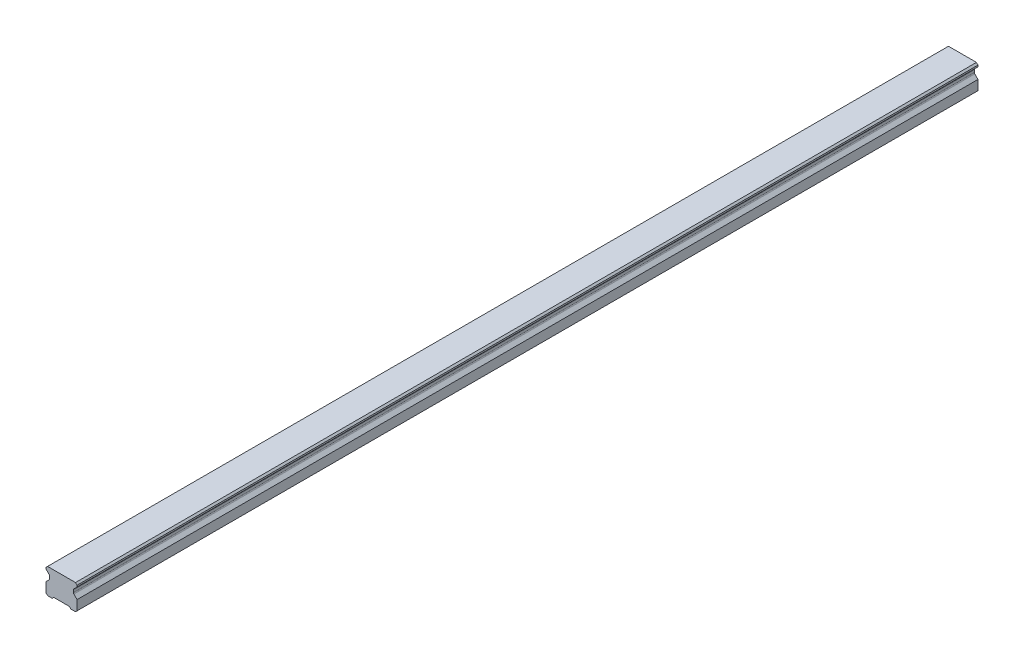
from build123d import *

# Parameters (mm, degrees)
SKETCH1_W           = 20
SKETCH1_H           = 16.3
BOSS_EXTRUDE1_DEPTH = 290
CUT_EXTRUDE1_DEPTH  = 581.315164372
CHAMFER1_SIZE       = 1
FILLET1_R           = 1
CUT_EXTRUDE2_DEPTH  = 581.315164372
SKETCH5_R           = 3
SKETCH5_R_2         = 2.5
CUT_EXTRUDE5_DEPTH  = 10
SKETCH5_2_R         = 2.5
CUT_EXTRUDE6_DEPTH  = 13
LPATTERN2_COUNT     = 10
LPATTERN2_PITCH     = 60


with BuildPart() as part:
    # Sketch1 → Boss-Extrude1 (new, symmetric)
    with BuildSketch(Plane.XY):
        with Locations((0, 8.15)):
            Rectangle(SKETCH1_W, SKETCH1_H)
    extrude(amount=BOSS_EXTRUDE1_DEPTH, both=True)

    # Sketch2 → Cut-Extrude1 (cut, through all)
    with BuildSketch(Plane.XY.offset(290)):
        Polygon((-10, 14.3), (-10, 7.3), (-7.666666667, 9.633333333), (-7.666666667, 11.966666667), align=None)
        Polygon((7.666666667, 11.966666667), (10, 14.3), (10, 7.3), (7.666666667, 9.633333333), align=None)
    extrude(amount=-CUT_EXTRUDE1_DEPTH, mode=Mode.SUBTRACT)

    # Chamfer1
    chamfer1_edges = [part.edges().sort_by_distance(p)[0] for p in [
        (-10, 16.3, 0),
        (10, 16.3, 0),
        (10, 0, 0),
        (-10, 0, 0),
    ]]
    chamfer(chamfer1_edges, length=CHAMFER1_SIZE)

    # Fillet1
    fillet1_edges = [part.edges().sort_by_distance(p)[0] for p in [
        (-7.666666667, 11.966666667, 0),
        (-7.666666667, 9.633333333, 0),
        (7.666666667, 9.633333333, 0),
        (7.666666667, 11.966666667, 0),
    ]]
    fillet(fillet1_edges, radius=FILLET1_R)

    # Sketch3 → Cut-Extrude2 (cut, through all)
    with BuildSketch(Plane.XY.offset(290)):
        Polygon((-6, 0), (-5, 1), (5, 1), (6, 0), align=None)
    extrude(amount=-CUT_EXTRUDE2_DEPTH, mode=Mode.SUBTRACT)

    # Sketch5 → Cut-Extrude5 (cut)
    with BuildSketch(Plane.XZ.offset(-1)):
        with Locations(Location((0, 270, 0), (0, 0, 270))):
            Circle(SKETCH5_R)
        with Locations(Location((0, 270, 0), (0, 0, 270))):
            Circle(SKETCH5_R_2, mode=Mode.SUBTRACT)
    cut_extrude5 = extrude(amount=-CUT_EXTRUDE5_DEPTH, mode=Mode.SUBTRACT)

    # Sketch5_2 → Cut-Extrude6 (cut)
    with BuildSketch(Plane.XZ.offset(-1)):
        with Locations(Location((0, 270, 0), (0, 0, 270))):
            Circle(SKETCH5_2_R)
    cut_extrude6 = extrude(amount=-CUT_EXTRUDE6_DEPTH, mode=Mode.SUBTRACT)

    # Cut-Extrude7 cone 1 section (on through the dimple's axis) → Cut-Extrude7 (revolve, cut)
    with BuildSketch(Plane(origin=(0, 14, 270), x_dir=(0, 0, -1), z_dir=(1, 0, 0))):
        Polygon((0, 0), (2.5, 0), (0, 1.443375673), align=None)
    cut_extrude7 = revolve(axis=Axis((0, 14, 270), (0, 1, 0)), mode=Mode.SUBTRACT)

    # LPattern2: Cut-Extrude5, Cut-Extrude6, Cut-Extrude7 ×10
    with Locations(*[(0, 0, -i * LPATTERN2_PITCH) for i in range(1, LPATTERN2_COUNT)]):
        add(cut_extrude5, mode=Mode.SUBTRACT)
        add(cut_extrude6, mode=Mode.SUBTRACT)
        add(cut_extrude7, mode=Mode.SUBTRACT)


solid = part.part
